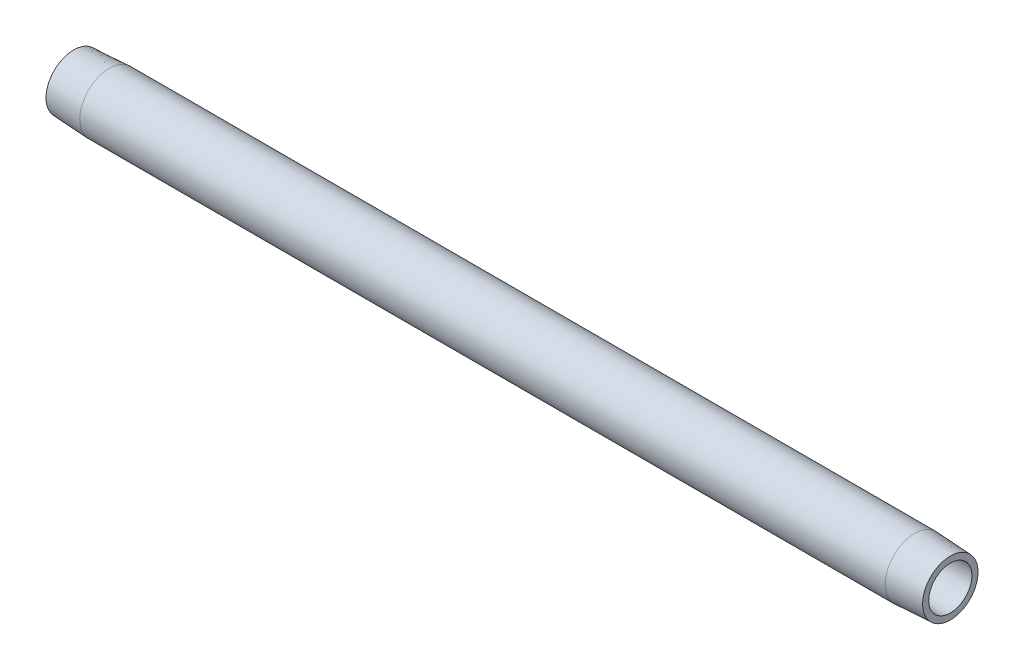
ISO-10303-21;
HEADER;
FILE_DESCRIPTION(('STEP AP214'),'2;1');
FILE_NAME('part.step','',(''),(''),'','','');
FILE_SCHEMA(('AUTOMOTIVE_DESIGN { 1 0 10303 214 1 1 1 1 }'));
ENDSEC;
DATA;
#1=APPLICATION_CONTEXT('core data for automotive mechanical design processes');
#2=APPLICATION_PROTOCOL_DEFINITION('international standard','automotive_design',2000,#1);
#3=PRODUCT_CONTEXT('',#1,'mechanical');
#4=PRODUCT('Part','Part','',(#3));
#5=PRODUCT_RELATED_PRODUCT_CATEGORY('part','',(#4));
#6=PRODUCT_DEFINITION_FORMATION('','',#4);
#7=PRODUCT_DEFINITION_CONTEXT('part definition',#1,'design');
#8=PRODUCT_DEFINITION('design','',#6,#7);
#9=PRODUCT_DEFINITION_SHAPE('','',#8);
#10=(LENGTH_UNIT() NAMED_UNIT(*) SI_UNIT(.MILLI.,.METRE.));
#11=(NAMED_UNIT(*) PLANE_ANGLE_UNIT() SI_UNIT($,.RADIAN.));
#12=(NAMED_UNIT(*) SI_UNIT($,.STERADIAN.) SOLID_ANGLE_UNIT());
#13=UNCERTAINTY_MEASURE_WITH_UNIT(LENGTH_MEASURE(1.E-05),#10,'distance_accuracy_value','');
#14=(GEOMETRIC_REPRESENTATION_CONTEXT(3) GLOBAL_UNCERTAINTY_ASSIGNED_CONTEXT((#13)) GLOBAL_UNIT_ASSIGNED_CONTEXT((#10,
#11,#12)) REPRESENTATION_CONTEXT('',''));
#15=CARTESIAN_POINT('',(0.,0.,0.));
#16=DIRECTION('',(0.,0.,1.));
#17=DIRECTION('',(1.,0.,0.));
#18=AXIS2_PLACEMENT_3D('',#15,#16,#17);
#19=CARTESIAN_POINT('',(254.,6.26110000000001,0.));
#20=DIRECTION('',(-1.,0.,0.));
#21=DIRECTION('',(0.,0.,1.));
#22=AXIS2_PLACEMENT_3D('',#19,#20,#21);
#23=PLANE('',#22);
#24=CARTESIAN_POINT('',(254.,0.,0.));
#25=DIRECTION('',(-1.,0.,0.));
#26=DIRECTION('',(0.,0.,1.));
#27=AXIS2_PLACEMENT_3D('',#24,#25,#26);
#28=CIRCLE('',#27,8.03205001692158);
#29=CARTESIAN_POINT('',(254.,0.,8.03205001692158));
#30=VERTEX_POINT('',#29);
#31=EDGE_CURVE('E10',#30,#30,#28,.T.);
#32=ORIENTED_EDGE('',*,*,#31,.F.);
#33=EDGE_LOOP('',(#32));
#34=FACE_BOUND('',#33,.T.);
#35=CARTESIAN_POINT('',(254.,0.,0.));
#36=DIRECTION('',(-1.,0.,0.));
#37=DIRECTION('',(0.,0.,1.));
#38=AXIS2_PLACEMENT_3D('',#35,#36,#37);
#39=CIRCLE('',#38,6.26110000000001);
#40=CARTESIAN_POINT('',(254.,0.,6.26110000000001));
#41=VERTEX_POINT('',#40);
#42=EDGE_CURVE('E52',#41,#41,#39,.T.);
#43=ORIENTED_EDGE('',*,*,#42,.T.);
#44=EDGE_LOOP('',(#43));
#45=FACE_BOUND('',#44,.T.);
#46=ADVANCED_FACE('F30',(#34,#45),#23,.F.);
#47=CARTESIAN_POINT('',(254.,0.,0.));
#48=DIRECTION('',(-1.,0.,0.));
#49=DIRECTION('',(0.,0.,1.));
#50=AXIS2_PLACEMENT_3D('',#47,#48,#49);
#51=CONICAL_SURFACE('',#50,8.03205001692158,0.0523598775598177);
#52=CARTESIAN_POINT('',(243.6876,0.,0.));
#53=DIRECTION('',(-1.,0.,0.));
#54=DIRECTION('',(0.,0.,1.));
#55=AXIS2_PLACEMENT_3D('',#52,#53,#54);
#56=CIRCLE('',#55,8.57249999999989);
#57=CARTESIAN_POINT('',(243.6876,0.,8.57249999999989));
#58=VERTEX_POINT('',#57);
#59=EDGE_CURVE('E36',#58,#58,#56,.T.);
#60=ORIENTED_EDGE('',*,*,#59,.F.);
#61=EDGE_LOOP('',(#60));
#62=FACE_BOUND('',#61,.T.);
#63=ORIENTED_EDGE('',*,*,#31,.T.);
#64=EDGE_LOOP('',(#63));
#65=FACE_BOUND('',#64,.T.);
#66=ADVANCED_FACE('F77',(#62,#65),#51,.T.);
#67=CARTESIAN_POINT('',(0.,0.,0.));
#68=DIRECTION('',(-1.,0.,0.));
#69=DIRECTION('',(0.,0.,1.));
#70=AXIS2_PLACEMENT_3D('',#67,#68,#69);
#71=CYLINDRICAL_SURFACE('',#70,8.57249999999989);
#72=CARTESIAN_POINT('',(10.3124,0.,0.));
#73=DIRECTION('',(-1.,0.,0.));
#74=DIRECTION('',(0.,0.,1.));
#75=AXIS2_PLACEMENT_3D('',#72,#73,#74);
#76=CIRCLE('',#75,8.57249999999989);
#77=CARTESIAN_POINT('',(10.3124,0.,8.57249999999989));
#78=VERTEX_POINT('',#77);
#79=EDGE_CURVE('E40',#78,#78,#76,.T.);
#80=ORIENTED_EDGE('',*,*,#79,.F.);
#81=EDGE_LOOP('',(#80));
#82=FACE_BOUND('',#81,.T.);
#83=ORIENTED_EDGE('',*,*,#59,.T.);
#84=EDGE_LOOP('',(#83));
#85=FACE_BOUND('',#84,.T.);
#86=ADVANCED_FACE('F72',(#82,#85),#71,.T.);
#87=CARTESIAN_POINT('',(10.3124,0.,0.));
#88=DIRECTION('',(1.,0.,0.));
#89=DIRECTION('',(0.,0.,-1.));
#90=AXIS2_PLACEMENT_3D('',#87,#88,#89);
#91=CONICAL_SURFACE('',#90,8.57249999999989,0.0523598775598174);
#92=CARTESIAN_POINT('',(0.,0.,0.));
#93=DIRECTION('',(-1.,0.,0.));
#94=DIRECTION('',(0.,0.,1.));
#95=AXIS2_PLACEMENT_3D('',#92,#93,#94);
#96=CIRCLE('',#95,8.03205001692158);
#97=CARTESIAN_POINT('',(0.,0.,8.03205001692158));
#98=VERTEX_POINT('',#97);
#99=EDGE_CURVE('E44',#98,#98,#96,.T.);
#100=ORIENTED_EDGE('',*,*,#99,.F.);
#101=EDGE_LOOP('',(#100));
#102=FACE_BOUND('',#101,.T.);
#103=ORIENTED_EDGE('',*,*,#79,.T.);
#104=EDGE_LOOP('',(#103));
#105=FACE_BOUND('',#104,.T.);
#106=ADVANCED_FACE('F66',(#102,#105),#91,.T.);
#107=CARTESIAN_POINT('',(0.,6.26110000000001,0.));
#108=DIRECTION('',(1.,0.,0.));
#109=DIRECTION('',(0.,0.,-1.));
#110=AXIS2_PLACEMENT_3D('',#107,#108,#109);
#111=PLANE('',#110);
#112=CARTESIAN_POINT('',(0.,0.,0.));
#113=DIRECTION('',(-1.,0.,0.));
#114=DIRECTION('',(0.,0.,1.));
#115=AXIS2_PLACEMENT_3D('',#112,#113,#114);
#116=CIRCLE('',#115,6.26110000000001);
#117=CARTESIAN_POINT('',(0.,0.,6.26110000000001));
#118=VERTEX_POINT('',#117);
#119=EDGE_CURVE('E49',#118,#118,#116,.T.);
#120=ORIENTED_EDGE('',*,*,#119,.F.);
#121=EDGE_LOOP('',(#120));
#122=FACE_BOUND('',#121,.T.);
#123=ORIENTED_EDGE('',*,*,#99,.T.);
#124=EDGE_LOOP('',(#123));
#125=FACE_BOUND('',#124,.T.);
#126=ADVANCED_FACE('F60',(#122,#125),#111,.F.);
#127=CARTESIAN_POINT('',(0.,0.,0.));
#128=DIRECTION('',(-1.,0.,0.));
#129=DIRECTION('',(0.,0.,1.));
#130=AXIS2_PLACEMENT_3D('',#127,#128,#129);
#131=CYLINDRICAL_SURFACE('',#130,6.26110000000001);
#132=ORIENTED_EDGE('',*,*,#42,.F.);
#133=EDGE_LOOP('',(#132));
#134=FACE_BOUND('',#133,.T.);
#135=ORIENTED_EDGE('',*,*,#119,.T.);
#136=EDGE_LOOP('',(#135));
#137=FACE_BOUND('',#136,.T.);
#138=ADVANCED_FACE('F57',(#134,#137),#131,.F.);
#139=CLOSED_SHELL('',(#46,#66,#86,#106,#126,#138));
#140=MANIFOLD_SOLID_BREP('B2',#139);
#141=ADVANCED_BREP_SHAPE_REPRESENTATION('',(#18,#140),#14);
#142=SHAPE_DEFINITION_REPRESENTATION(#9,#141);
ENDSEC;
END-ISO-10303-21;
